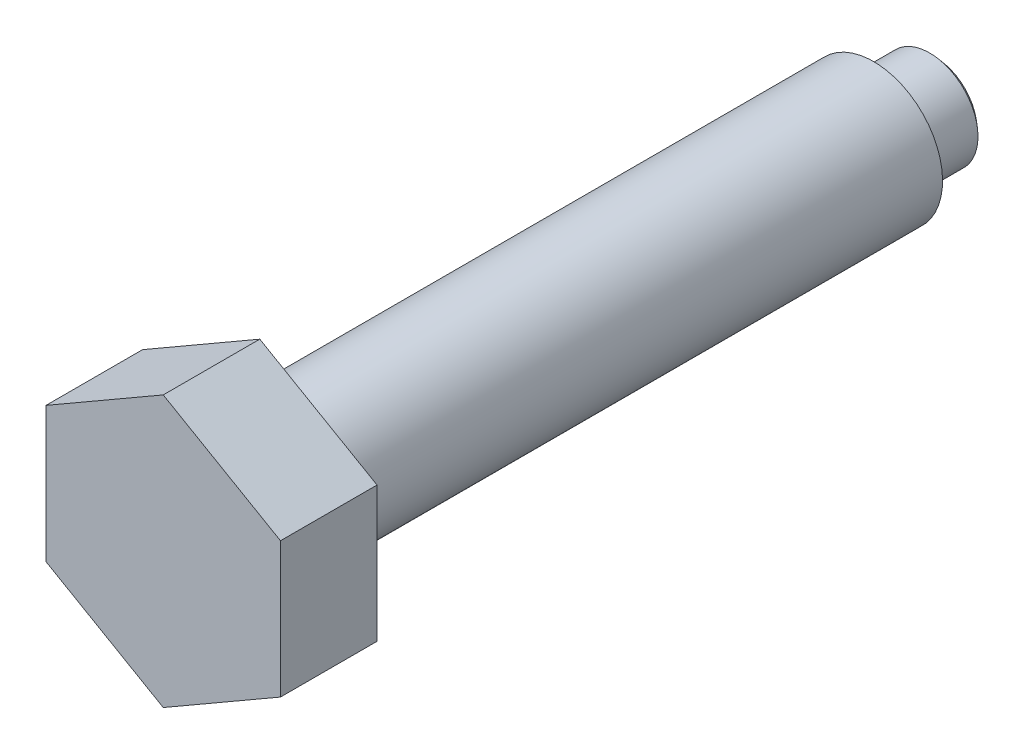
ISO-10303-21;
HEADER;
FILE_DESCRIPTION(('STEP AP214'),'2;1');
FILE_NAME('part.step','',(''),(''),'','','');
FILE_SCHEMA(('AUTOMOTIVE_DESIGN { 1 0 10303 214 1 1 1 1 }'));
ENDSEC;
DATA;
#1=APPLICATION_CONTEXT('core data for automotive mechanical design processes');
#2=APPLICATION_PROTOCOL_DEFINITION('international standard','automotive_design',2000,#1);
#3=PRODUCT_CONTEXT('',#1,'mechanical');
#4=PRODUCT('Part','Part','',(#3));
#5=PRODUCT_RELATED_PRODUCT_CATEGORY('part','',(#4));
#6=PRODUCT_DEFINITION_FORMATION('','',#4);
#7=PRODUCT_DEFINITION_CONTEXT('part definition',#1,'design');
#8=PRODUCT_DEFINITION('design','',#6,#7);
#9=PRODUCT_DEFINITION_SHAPE('','',#8);
#10=(LENGTH_UNIT() NAMED_UNIT(*) SI_UNIT(.MILLI.,.METRE.));
#11=(NAMED_UNIT(*) PLANE_ANGLE_UNIT() SI_UNIT($,.RADIAN.));
#12=(NAMED_UNIT(*) SI_UNIT($,.STERADIAN.) SOLID_ANGLE_UNIT());
#13=UNCERTAINTY_MEASURE_WITH_UNIT(LENGTH_MEASURE(1.E-05),#10,'distance_accuracy_value','');
#14=(GEOMETRIC_REPRESENTATION_CONTEXT(3) GLOBAL_UNCERTAINTY_ASSIGNED_CONTEXT((#13)) GLOBAL_UNIT_ASSIGNED_CONTEXT((#10,
#11,#12)) REPRESENTATION_CONTEXT('',''));
#15=CARTESIAN_POINT('',(0.,0.,0.));
#16=DIRECTION('',(0.,0.,1.));
#17=DIRECTION('',(1.,0.,0.));
#18=AXIS2_PLACEMENT_3D('',#15,#16,#17);
#19=CARTESIAN_POINT('',(8.5,4.90747728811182,0.));
#20=DIRECTION('',(0.,0.,-1.));
#21=DIRECTION('',(0.,1.,0.));
#22=AXIS2_PLACEMENT_3D('',#19,#20,#21);
#23=PLANE('',#22);
#24=DIRECTION('',(-0.866025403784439,0.5,0.));
#25=VECTOR('',#24,1.);
#26=CARTESIAN_POINT('',(8.5,4.90747728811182,0.));
#27=LINE('',#26,#25);
#28=CARTESIAN_POINT('',(8.5,4.90747728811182,0.));
#29=VERTEX_POINT('',#28);
#30=CARTESIAN_POINT('',(0.,9.81495457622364,0.));
#31=VERTEX_POINT('',#30);
#32=EDGE_CURVE('E99',#29,#31,#27,.T.);
#33=ORIENTED_EDGE('',*,*,#32,.F.);
#34=DIRECTION('',(0.,1.,0.));
#35=VECTOR('',#34,1.);
#36=CARTESIAN_POINT('',(8.5,-4.90747728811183,0.));
#37=LINE('',#36,#35);
#38=CARTESIAN_POINT('',(8.5,-4.90747728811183,0.));
#39=VERTEX_POINT('',#38);
#40=EDGE_CURVE('E60',#39,#29,#37,.T.);
#41=ORIENTED_EDGE('',*,*,#40,.F.);
#42=DIRECTION('',(0.866025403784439,0.5,0.));
#43=VECTOR('',#42,1.);
#44=CARTESIAN_POINT('',(0.,-9.81495457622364,0.));
#45=LINE('',#44,#43);
#46=CARTESIAN_POINT('',(0.,-9.81495457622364,0.));
#47=VERTEX_POINT('',#46);
#48=EDGE_CURVE('E54',#47,#39,#45,.T.);
#49=ORIENTED_EDGE('',*,*,#48,.F.);
#50=DIRECTION('',(0.866025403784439,-0.5,0.));
#51=VECTOR('',#50,1.);
#52=CARTESIAN_POINT('',(-8.5,-4.90747728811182,0.));
#53=LINE('',#52,#51);
#54=CARTESIAN_POINT('',(-8.5,-4.90747728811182,0.));
#55=VERTEX_POINT('',#54);
#56=EDGE_CURVE('E89',#55,#47,#53,.T.);
#57=ORIENTED_EDGE('',*,*,#56,.F.);
#58=DIRECTION('',(0.,-1.,0.));
#59=VECTOR('',#58,1.);
#60=CARTESIAN_POINT('',(-8.5,4.90747728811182,0.));
#61=LINE('',#60,#59);
#62=CARTESIAN_POINT('',(-8.5,4.90747728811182,0.));
#63=VERTEX_POINT('',#62);
#64=EDGE_CURVE('E105',#63,#55,#61,.T.);
#65=ORIENTED_EDGE('',*,*,#64,.F.);
#66=DIRECTION('',(-0.866025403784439,-0.5,0.));
#67=VECTOR('',#66,1.);
#68=CARTESIAN_POINT('',(0.,9.81495457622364,0.));
#69=LINE('',#68,#67);
#70=EDGE_CURVE('E102',#31,#63,#69,.T.);
#71=ORIENTED_EDGE('',*,*,#70,.F.);
#72=EDGE_LOOP('',(#33,#41,#49,#57,#65,#71));
#73=FACE_BOUND('',#72,.T.);
#74=CARTESIAN_POINT('',(0.,0.,0.));
#75=DIRECTION('',(0.,0.,1.));
#76=DIRECTION('',(0.,-1.,0.));
#77=AXIS2_PLACEMENT_3D('',#74,#75,#76);
#78=CIRCLE('',#77,5.);
#79=CARTESIAN_POINT('',(0.,-5.,0.));
#80=VERTEX_POINT('',#79);
#81=EDGE_CURVE('E103',#80,#80,#78,.T.);
#82=ORIENTED_EDGE('',*,*,#81,.T.);
#83=EDGE_LOOP('',(#82));
#84=FACE_BOUND('',#83,.T.);
#85=ADVANCED_FACE('F14',(#73,#84),#23,.T.);
#86=CARTESIAN_POINT('',(8.5,4.90747728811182,7.));
#87=DIRECTION('',(-0.5,-0.866025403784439,0.));
#88=DIRECTION('',(0.866025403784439,-0.5,0.));
#89=AXIS2_PLACEMENT_3D('',#86,#87,#88);
#90=PLANE('',#89);
#91=ORIENTED_EDGE('',*,*,#32,.T.);
#92=DIRECTION('',(0.,0.,-1.));
#93=VECTOR('',#92,1.);
#94=CARTESIAN_POINT('',(0.,9.81495457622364,7.));
#95=LINE('',#94,#93);
#96=CARTESIAN_POINT('',(0.,9.81495457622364,7.));
#97=VERTEX_POINT('',#96);
#98=EDGE_CURVE('E9',#97,#31,#95,.T.);
#99=ORIENTED_EDGE('',*,*,#98,.F.);
#100=DIRECTION('',(-0.866025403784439,0.5,0.));
#101=VECTOR('',#100,1.);
#102=CARTESIAN_POINT('',(8.5,4.90747728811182,7.));
#103=LINE('',#102,#101);
#104=CARTESIAN_POINT('',(8.5,4.90747728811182,7.));
#105=VERTEX_POINT('',#104);
#106=EDGE_CURVE('E110',#105,#97,#103,.T.);
#107=ORIENTED_EDGE('',*,*,#106,.F.);
#108=DIRECTION('',(0.,0.,-1.));
#109=VECTOR('',#108,1.);
#110=CARTESIAN_POINT('',(8.5,4.90747728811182,7.));
#111=LINE('',#110,#109);
#112=EDGE_CURVE('E95',#105,#29,#111,.T.);
#113=ORIENTED_EDGE('',*,*,#112,.T.);
#114=EDGE_LOOP('',(#91,#99,#107,#113));
#115=FACE_BOUND('',#114,.T.);
#116=ADVANCED_FACE('F16',(#115),#90,.F.);
#117=CARTESIAN_POINT('',(0.,9.81495457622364,7.));
#118=DIRECTION('',(0.5,-0.866025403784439,0.));
#119=DIRECTION('',(0.866025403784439,0.5,0.));
#120=AXIS2_PLACEMENT_3D('',#117,#118,#119);
#121=PLANE('',#120);
#122=ORIENTED_EDGE('',*,*,#70,.T.);
#123=DIRECTION('',(0.,0.,-1.));
#124=VECTOR('',#123,1.);
#125=CARTESIAN_POINT('',(-8.5,4.90747728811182,7.));
#126=LINE('',#125,#124);
#127=CARTESIAN_POINT('',(-8.5,4.90747728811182,7.));
#128=VERTEX_POINT('',#127);
#129=EDGE_CURVE('E23',#128,#63,#126,.T.);
#130=ORIENTED_EDGE('',*,*,#129,.F.);
#131=DIRECTION('',(-0.866025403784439,-0.5,0.));
#132=VECTOR('',#131,1.);
#133=CARTESIAN_POINT('',(0.,9.81495457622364,7.));
#134=LINE('',#133,#132);
#135=EDGE_CURVE('E68',#97,#128,#134,.T.);
#136=ORIENTED_EDGE('',*,*,#135,.F.);
#137=ORIENTED_EDGE('',*,*,#98,.T.);
#138=EDGE_LOOP('',(#122,#130,#136,#137));
#139=FACE_BOUND('',#138,.T.);
#140=ADVANCED_FACE('F141',(#139),#121,.F.);
#141=CARTESIAN_POINT('',(-8.5,4.90747728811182,7.));
#142=DIRECTION('',(1.,0.,0.));
#143=DIRECTION('',(0.,1.,0.));
#144=AXIS2_PLACEMENT_3D('',#141,#142,#143);
#145=PLANE('',#144);
#146=ORIENTED_EDGE('',*,*,#64,.T.);
#147=DIRECTION('',(0.,0.,-1.));
#148=VECTOR('',#147,1.);
#149=CARTESIAN_POINT('',(-8.5,-4.90747728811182,7.));
#150=LINE('',#149,#148);
#151=CARTESIAN_POINT('',(-8.5,-4.90747728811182,7.));
#152=VERTEX_POINT('',#151);
#153=EDGE_CURVE('E90',#152,#55,#150,.T.);
#154=ORIENTED_EDGE('',*,*,#153,.F.);
#155=DIRECTION('',(0.,-1.,0.));
#156=VECTOR('',#155,1.);
#157=CARTESIAN_POINT('',(-8.5,4.90747728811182,7.));
#158=LINE('',#157,#156);
#159=EDGE_CURVE('E81',#128,#152,#158,.T.);
#160=ORIENTED_EDGE('',*,*,#159,.F.);
#161=ORIENTED_EDGE('',*,*,#129,.T.);
#162=EDGE_LOOP('',(#146,#154,#160,#161));
#163=FACE_BOUND('',#162,.T.);
#164=ADVANCED_FACE('F116',(#163),#145,.F.);
#165=CARTESIAN_POINT('',(-8.5,-4.90747728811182,7.));
#166=DIRECTION('',(0.5,0.866025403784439,0.));
#167=DIRECTION('',(-0.866025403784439,0.5,0.));
#168=AXIS2_PLACEMENT_3D('',#165,#166,#167);
#169=PLANE('',#168);
#170=ORIENTED_EDGE('',*,*,#56,.T.);
#171=DIRECTION('',(0.,0.,-1.));
#172=VECTOR('',#171,1.);
#173=CARTESIAN_POINT('',(0.,-9.81495457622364,7.));
#174=LINE('',#173,#172);
#175=CARTESIAN_POINT('',(0.,-9.81495457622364,7.));
#176=VERTEX_POINT('',#175);
#177=EDGE_CURVE('E86',#176,#47,#174,.T.);
#178=ORIENTED_EDGE('',*,*,#177,.F.);
#179=DIRECTION('',(0.866025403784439,-0.5,0.));
#180=VECTOR('',#179,1.);
#181=CARTESIAN_POINT('',(-8.5,-4.90747728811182,7.));
#182=LINE('',#181,#180);
#183=EDGE_CURVE('E75',#152,#176,#182,.T.);
#184=ORIENTED_EDGE('',*,*,#183,.F.);
#185=ORIENTED_EDGE('',*,*,#153,.T.);
#186=EDGE_LOOP('',(#170,#178,#184,#185));
#187=FACE_BOUND('',#186,.T.);
#188=ADVANCED_FACE('F87',(#187),#169,.F.);
#189=CARTESIAN_POINT('',(0.,-9.81495457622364,7.));
#190=DIRECTION('',(-0.5,0.866025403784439,0.));
#191=DIRECTION('',(-0.866025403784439,-0.5,0.));
#192=AXIS2_PLACEMENT_3D('',#189,#190,#191);
#193=PLANE('',#192);
#194=ORIENTED_EDGE('',*,*,#48,.T.);
#195=DIRECTION('',(0.,0.,-1.));
#196=VECTOR('',#195,1.);
#197=CARTESIAN_POINT('',(8.5,-4.90747728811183,7.));
#198=LINE('',#197,#196);
#199=CARTESIAN_POINT('',(8.5,-4.90747728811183,7.));
#200=VERTEX_POINT('',#199);
#201=EDGE_CURVE('E91',#200,#39,#198,.T.);
#202=ORIENTED_EDGE('',*,*,#201,.F.);
#203=DIRECTION('',(0.866025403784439,0.5,0.));
#204=VECTOR('',#203,1.);
#205=CARTESIAN_POINT('',(0.,-9.81495457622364,7.));
#206=LINE('',#205,#204);
#207=EDGE_CURVE('E79',#176,#200,#206,.T.);
#208=ORIENTED_EDGE('',*,*,#207,.F.);
#209=ORIENTED_EDGE('',*,*,#177,.T.);
#210=EDGE_LOOP('',(#194,#202,#208,#209));
#211=FACE_BOUND('',#210,.T.);
#212=ADVANCED_FACE('F93',(#211),#193,.F.);
#213=CARTESIAN_POINT('',(8.5,-4.90747728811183,7.));
#214=DIRECTION('',(-1.,0.,0.));
#215=DIRECTION('',(0.,-1.,0.));
#216=AXIS2_PLACEMENT_3D('',#213,#214,#215);
#217=PLANE('',#216);
#218=ORIENTED_EDGE('',*,*,#40,.T.);
#219=ORIENTED_EDGE('',*,*,#112,.F.);
#220=DIRECTION('',(0.,1.,0.));
#221=VECTOR('',#220,1.);
#222=CARTESIAN_POINT('',(8.5,-4.90747728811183,7.));
#223=LINE('',#222,#221);
#224=EDGE_CURVE('E31',#200,#105,#223,.T.);
#225=ORIENTED_EDGE('',*,*,#224,.F.);
#226=ORIENTED_EDGE('',*,*,#201,.T.);
#227=EDGE_LOOP('',(#218,#219,#225,#226));
#228=FACE_BOUND('',#227,.T.);
#229=ADVANCED_FACE('F123',(#228),#217,.F.);
#230=CARTESIAN_POINT('',(8.5,4.90747728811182,7.));
#231=DIRECTION('',(0.,0.,-1.));
#232=DIRECTION('',(0.,1.,0.));
#233=AXIS2_PLACEMENT_3D('',#230,#231,#232);
#234=PLANE('',#233);
#235=ORIENTED_EDGE('',*,*,#106,.T.);
#236=ORIENTED_EDGE('',*,*,#135,.T.);
#237=ORIENTED_EDGE('',*,*,#159,.T.);
#238=ORIENTED_EDGE('',*,*,#183,.T.);
#239=ORIENTED_EDGE('',*,*,#207,.T.);
#240=ORIENTED_EDGE('',*,*,#224,.T.);
#241=EDGE_LOOP('',(#235,#236,#237,#238,#239,#240));
#242=FACE_BOUND('',#241,.T.);
#243=ADVANCED_FACE('F77',(#242),#234,.F.);
#244=CARTESIAN_POINT('',(0.,0.,0.));
#245=DIRECTION('',(0.,0.,1.));
#246=DIRECTION('',(0.,-1.,0.));
#247=AXIS2_PLACEMENT_3D('',#244,#245,#246);
#248=CYLINDRICAL_SURFACE('',#247,5.);
#249=ORIENTED_EDGE('',*,*,#81,.F.);
#250=EDGE_LOOP('',(#249));
#251=FACE_BOUND('',#250,.T.);
#252=CARTESIAN_POINT('',(0.,0.,-44.5));
#253=DIRECTION('',(0.,0.,1.));
#254=DIRECTION('',(0.,-1.,0.));
#255=AXIS2_PLACEMENT_3D('',#252,#253,#254);
#256=CIRCLE('',#255,5.);
#257=CARTESIAN_POINT('',(0.,-5.,-44.5));
#258=VERTEX_POINT('',#257);
#259=EDGE_CURVE('E167',#258,#258,#256,.T.);
#260=ORIENTED_EDGE('',*,*,#259,.T.);
#261=EDGE_LOOP('',(#260));
#262=FACE_BOUND('',#261,.T.);
#263=ADVANCED_FACE('F132',(#251,#262),#248,.T.);
#264=CARTESIAN_POINT('',(0.,0.,-45.3660254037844));
#265=DIRECTION('',(0.,0.,1.));
#266=DIRECTION('',(0.,-1.,0.));
#267=AXIS2_PLACEMENT_3D('',#264,#265,#266);
#268=CONICAL_SURFACE('',#267,3.5,1.0471975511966);
#269=ORIENTED_EDGE('',*,*,#259,.F.);
#270=EDGE_LOOP('',(#269));
#271=FACE_BOUND('',#270,.T.);
#272=CARTESIAN_POINT('',(0.,0.,-45.3660254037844));
#273=DIRECTION('',(0.,0.,1.));
#274=DIRECTION('',(0.,-1.,0.));
#275=AXIS2_PLACEMENT_3D('',#272,#273,#274);
#276=CIRCLE('',#275,3.5);
#277=CARTESIAN_POINT('',(0.,-3.5,-45.3660254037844));
#278=VERTEX_POINT('',#277);
#279=EDGE_CURVE('E164',#278,#278,#276,.T.);
#280=ORIENTED_EDGE('',*,*,#279,.T.);
#281=EDGE_LOOP('',(#280));
#282=FACE_BOUND('',#281,.T.);
#283=ADVANCED_FACE('F145',(#271,#282),#268,.T.);
#284=CARTESIAN_POINT('',(0.,0.,0.));
#285=DIRECTION('',(0.,0.,1.));
#286=DIRECTION('',(0.,-1.,0.));
#287=AXIS2_PLACEMENT_3D('',#284,#285,#286);
#288=CYLINDRICAL_SURFACE('',#287,3.5);
#289=ORIENTED_EDGE('',*,*,#279,.F.);
#290=EDGE_LOOP('',(#289));
#291=FACE_BOUND('',#290,.T.);
#292=CARTESIAN_POINT('',(0.,0.,-48.5707142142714));
#293=DIRECTION('',(0.,0.,1.));
#294=DIRECTION('',(0.,-1.,0.));
#295=AXIS2_PLACEMENT_3D('',#292,#293,#294);
#296=CIRCLE('',#295,3.5);
#297=CARTESIAN_POINT('',(0.,-3.5,-48.5707142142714));
#298=VERTEX_POINT('',#297);
#299=EDGE_CURVE('E162',#298,#298,#296,.T.);
#300=ORIENTED_EDGE('',*,*,#299,.T.);
#301=EDGE_LOOP('',(#300));
#302=FACE_BOUND('',#301,.T.);
#303=ADVANCED_FACE('F149',(#291,#302),#288,.T.);
#304=CARTESIAN_POINT('',(0.,0.,-45.));
#305=DIRECTION('',(0.,0.,1.));
#306=DIRECTION('',(1.,0.,0.));
#307=AXIS2_PLACEMENT_3D('',#304,#305,#306);
#308=SPHERICAL_SURFACE('',#307,5.);
#309=ORIENTED_EDGE('',*,*,#299,.F.);
#310=EDGE_LOOP('',(#309));
#311=FACE_BOUND('',#310,.T.);
#312=ADVANCED_FACE('F153',(#311),#308,.T.);
#313=CLOSED_SHELL('',(#85,#116,#140,#164,#188,#212,#229,#243,#263,#283,#303,#312));
#314=MANIFOLD_SOLID_BREP('B1',#313);
#315=ADVANCED_BREP_SHAPE_REPRESENTATION('',(#18,#314),#14);
#316=SHAPE_DEFINITION_REPRESENTATION(#9,#315);
ENDSEC;
END-ISO-10303-21;
